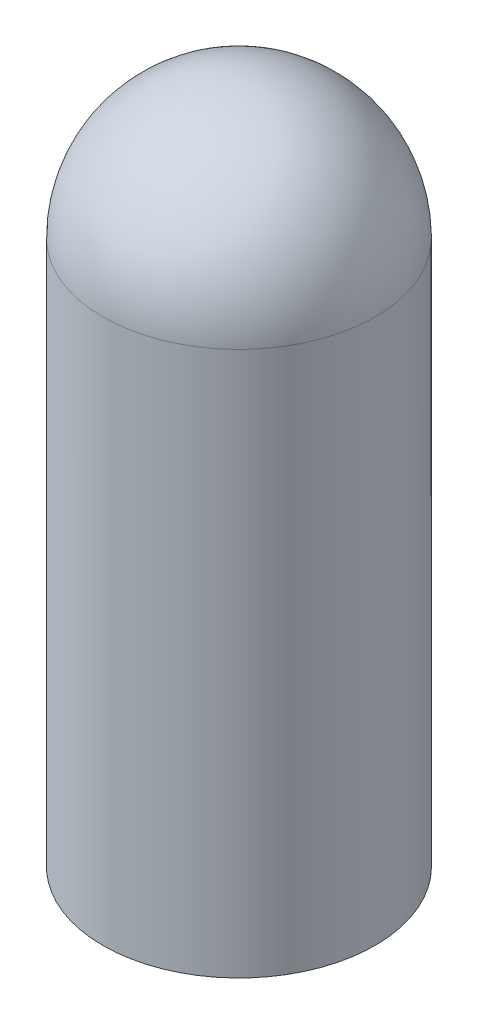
ISO-10303-21;
HEADER;
FILE_DESCRIPTION(('STEP AP214'),'2;1');
FILE_NAME('part.step','',(''),(''),'','','');
FILE_SCHEMA(('AUTOMOTIVE_DESIGN { 1 0 10303 214 1 1 1 1 }'));
ENDSEC;
DATA;
#1=APPLICATION_CONTEXT('core data for automotive mechanical design processes');
#2=APPLICATION_PROTOCOL_DEFINITION('international standard','automotive_design',2000,#1);
#3=PRODUCT_CONTEXT('',#1,'mechanical');
#4=PRODUCT('Part','Part','',(#3));
#5=PRODUCT_RELATED_PRODUCT_CATEGORY('part','',(#4));
#6=PRODUCT_DEFINITION_FORMATION('','',#4);
#7=PRODUCT_DEFINITION_CONTEXT('part definition',#1,'design');
#8=PRODUCT_DEFINITION('design','',#6,#7);
#9=PRODUCT_DEFINITION_SHAPE('','',#8);
#10=(LENGTH_UNIT() NAMED_UNIT(*) SI_UNIT(.MILLI.,.METRE.));
#11=(NAMED_UNIT(*) PLANE_ANGLE_UNIT() SI_UNIT($,.RADIAN.));
#12=(NAMED_UNIT(*) SI_UNIT($,.STERADIAN.) SOLID_ANGLE_UNIT());
#13=UNCERTAINTY_MEASURE_WITH_UNIT(LENGTH_MEASURE(1.E-05),#10,'distance_accuracy_value','');
#14=(GEOMETRIC_REPRESENTATION_CONTEXT(3) GLOBAL_UNCERTAINTY_ASSIGNED_CONTEXT((#13)) GLOBAL_UNIT_ASSIGNED_CONTEXT((#10,
#11,#12)) REPRESENTATION_CONTEXT('',''));
#15=CARTESIAN_POINT('',(0.,0.,0.));
#16=DIRECTION('',(0.,0.,1.));
#17=DIRECTION('',(1.,0.,0.));
#18=AXIS2_PLACEMENT_3D('',#15,#16,#17);
#19=CARTESIAN_POINT('',(49.75,-52.2375,0.));
#20=DIRECTION('',(0.,-1.,0.));
#21=DIRECTION('',(1.,0.,0.));
#22=AXIS2_PLACEMENT_3D('',#19,#20,#21);
#23=CYLINDRICAL_SURFACE('',#22,1.4925);
#24=CARTESIAN_POINT('',(49.75,-53.73,0.));
#25=DIRECTION('',(0.,-1.,0.));
#26=DIRECTION('',(0.,0.,1.));
#27=AXIS2_PLACEMENT_3D('',#24,#25,#26);
#28=CIRCLE('',#27,1.4925);
#29=CARTESIAN_POINT('',(49.75,-53.73,1.4925));
#30=VERTEX_POINT('',#29);
#31=EDGE_CURVE('E10',#30,#30,#28,.T.);
#32=ORIENTED_EDGE('',*,*,#31,.T.);
#33=EDGE_LOOP('',(#32));
#34=FACE_BOUND('',#33,.T.);
#35=CARTESIAN_POINT('',(49.75,-59.7,0.));
#36=DIRECTION('',(0.,1.,0.));
#37=DIRECTION('',(-1.,0.,0.));
#38=AXIS2_PLACEMENT_3D('',#35,#36,#37);
#39=CIRCLE('',#38,1.4925);
#40=CARTESIAN_POINT('',(48.2575,-59.7,0.));
#41=VERTEX_POINT('',#40);
#42=EDGE_CURVE('E21',#41,#41,#39,.T.);
#43=ORIENTED_EDGE('',*,*,#42,.T.);
#44=EDGE_LOOP('',(#43));
#45=FACE_BOUND('',#44,.T.);
#46=ADVANCED_FACE('F14',(#34,#45),#23,.T.);
#47=CARTESIAN_POINT('',(49.75,-59.7,0.));
#48=DIRECTION('',(0.,1.,0.));
#49=DIRECTION('',(-1.,0.,0.));
#50=AXIS2_PLACEMENT_3D('',#47,#48,#49);
#51=PLANE('',#50);
#52=ORIENTED_EDGE('',*,*,#42,.F.);
#53=EDGE_LOOP('',(#52));
#54=FACE_BOUND('',#53,.T.);
#55=ADVANCED_FACE('F47',(#54),#51,.F.);
#56=CARTESIAN_POINT('',(49.75,-53.73,0.));
#57=DIRECTION('',(0.,0.,1.));
#58=DIRECTION('',(-1.,0.,0.));
#59=AXIS2_PLACEMENT_3D('',#56,#57,#58);
#60=SPHERICAL_SURFACE('',#59,1.4925);
#61=CARTESIAN_POINT('',(49.75,-53.73,0.));
#62=DIRECTION('',(0.,-1.,0.));
#63=DIRECTION('',(0.,0.,1.));
#64=AXIS2_PLACEMENT_3D('',#61,#62,#63);
#65=SPHERICAL_SURFACE('',#64,1.4925);
#66=ORIENTED_EDGE('',*,*,#31,.F.);
#67=EDGE_LOOP('',(#66));
#68=FACE_BOUND('',#67,.T.);
#69=ADVANCED_FACE('F49',(#68),#65,.T.);
#70=CLOSED_SHELL('',(#46,#55,#69));
#71=MANIFOLD_SOLID_BREP('B1',#70);
#72=ADVANCED_BREP_SHAPE_REPRESENTATION('',(#18,#71),#14);
#73=SHAPE_DEFINITION_REPRESENTATION(#9,#72);
ENDSEC;
END-ISO-10303-21;
